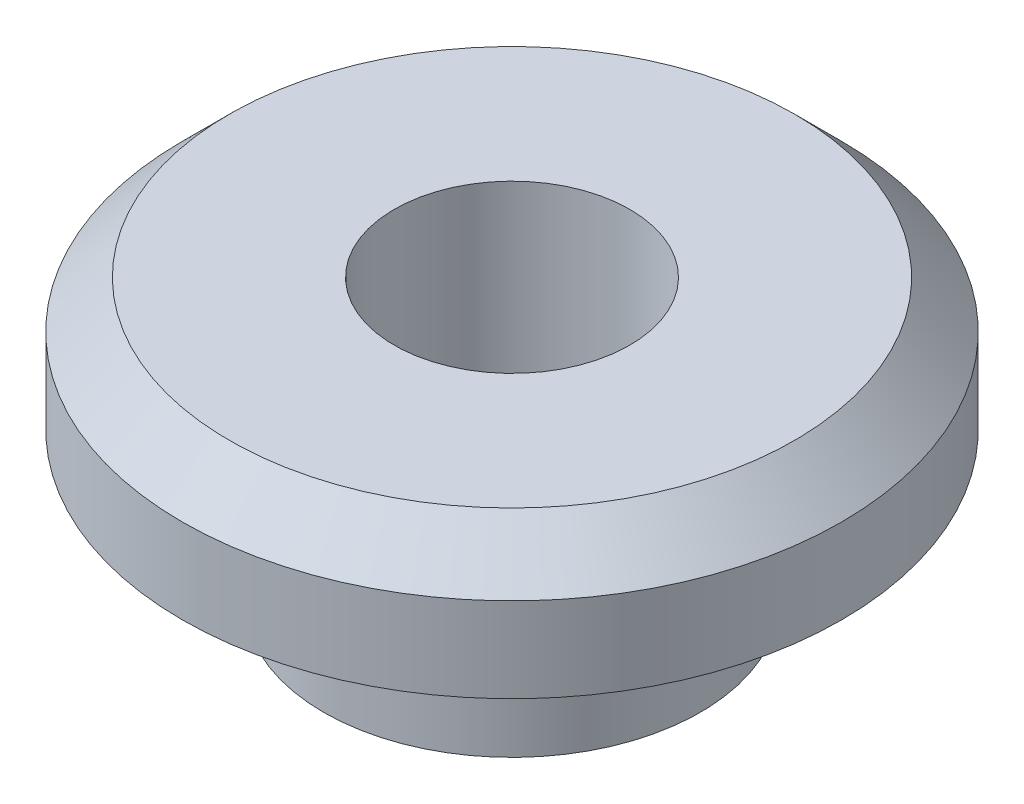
ISO-10303-21;
HEADER;
FILE_DESCRIPTION(('STEP AP214'),'2;1');
FILE_NAME('part.step','',(''),(''),'','','');
FILE_SCHEMA(('AUTOMOTIVE_DESIGN { 1 0 10303 214 1 1 1 1 }'));
ENDSEC;
DATA;
#1=APPLICATION_CONTEXT('core data for automotive mechanical design processes');
#2=APPLICATION_PROTOCOL_DEFINITION('international standard','automotive_design',2000,#1);
#3=PRODUCT_CONTEXT('',#1,'mechanical');
#4=PRODUCT('Part','Part','',(#3));
#5=PRODUCT_RELATED_PRODUCT_CATEGORY('part','',(#4));
#6=PRODUCT_DEFINITION_FORMATION('','',#4);
#7=PRODUCT_DEFINITION_CONTEXT('part definition',#1,'design');
#8=PRODUCT_DEFINITION('design','',#6,#7);
#9=PRODUCT_DEFINITION_SHAPE('','',#8);
#10=(LENGTH_UNIT() NAMED_UNIT(*) SI_UNIT(.MILLI.,.METRE.));
#11=(NAMED_UNIT(*) PLANE_ANGLE_UNIT() SI_UNIT($,.RADIAN.));
#12=(NAMED_UNIT(*) SI_UNIT($,.STERADIAN.) SOLID_ANGLE_UNIT());
#13=UNCERTAINTY_MEASURE_WITH_UNIT(LENGTH_MEASURE(1.E-05),#10,'distance_accuracy_value','');
#14=(GEOMETRIC_REPRESENTATION_CONTEXT(3) GLOBAL_UNCERTAINTY_ASSIGNED_CONTEXT((#13)) GLOBAL_UNIT_ASSIGNED_CONTEXT((#10,
#11,#12)) REPRESENTATION_CONTEXT('',''));
#15=CARTESIAN_POINT('',(0.,0.,0.));
#16=DIRECTION('',(0.,0.,1.));
#17=DIRECTION('',(1.,0.,0.));
#18=AXIS2_PLACEMENT_3D('',#15,#16,#17);
#19=CARTESIAN_POINT('',(0.,5.,0.));
#20=DIRECTION('',(0.,-1.,0.));
#21=DIRECTION('',(0.,0.,-1.));
#22=AXIS2_PLACEMENT_3D('',#19,#20,#21);
#23=CONICAL_SURFACE('',#22,7.,0.785398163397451);
#24=CARTESIAN_POINT('',(0.,6.,0.));
#25=DIRECTION('',(0.,-1.,0.));
#26=DIRECTION('',(0.,0.,-1.));
#27=AXIS2_PLACEMENT_3D('',#24,#25,#26);
#28=CIRCLE('',#27,6.);
#29=CARTESIAN_POINT('',(0.,6.,-6.));
#30=VERTEX_POINT('',#29);
#31=EDGE_CURVE('E54',#30,#30,#28,.T.);
#32=ORIENTED_EDGE('',*,*,#31,.T.);
#33=EDGE_LOOP('',(#32));
#34=FACE_BOUND('',#33,.T.);
#35=CARTESIAN_POINT('',(0.,5.,0.));
#36=DIRECTION('',(0.,-1.,0.));
#37=DIRECTION('',(0.,0.,-1.));
#38=AXIS2_PLACEMENT_3D('',#35,#36,#37);
#39=CIRCLE('',#38,7.);
#40=CARTESIAN_POINT('',(0.,5.,-7.));
#41=VERTEX_POINT('',#40);
#42=EDGE_CURVE('E10',#41,#41,#39,.T.);
#43=ORIENTED_EDGE('',*,*,#42,.F.);
#44=EDGE_LOOP('',(#43));
#45=FACE_BOUND('',#44,.T.);
#46=ADVANCED_FACE('F29',(#34,#45),#23,.T.);
#47=CARTESIAN_POINT('',(0.,0.,0.));
#48=DIRECTION('',(0.,-1.,0.));
#49=DIRECTION('',(0.,0.,-1.));
#50=AXIS2_PLACEMENT_3D('',#47,#48,#49);
#51=CYLINDRICAL_SURFACE('',#50,7.);
#52=ORIENTED_EDGE('',*,*,#42,.T.);
#53=EDGE_LOOP('',(#52));
#54=FACE_BOUND('',#53,.T.);
#55=CARTESIAN_POINT('',(0.,3.2,0.));
#56=DIRECTION('',(0.,-1.,0.));
#57=DIRECTION('',(0.,0.,-1.));
#58=AXIS2_PLACEMENT_3D('',#55,#56,#57);
#59=CIRCLE('',#58,7.);
#60=CARTESIAN_POINT('',(0.,3.2,-7.));
#61=VERTEX_POINT('',#60);
#62=EDGE_CURVE('E35',#61,#61,#59,.T.);
#63=ORIENTED_EDGE('',*,*,#62,.F.);
#64=EDGE_LOOP('',(#63));
#65=FACE_BOUND('',#64,.T.);
#66=ADVANCED_FACE('F72',(#54,#65),#51,.T.);
#67=CARTESIAN_POINT('',(7.,3.2,0.));
#68=DIRECTION('',(0.,-1.,0.));
#69=DIRECTION('',(0.,0.,-1.));
#70=AXIS2_PLACEMENT_3D('',#67,#68,#69);
#71=PLANE('',#70);
#72=ORIENTED_EDGE('',*,*,#62,.T.);
#73=EDGE_LOOP('',(#72));
#74=FACE_BOUND('',#73,.T.);
#75=CARTESIAN_POINT('',(0.,3.2,0.));
#76=DIRECTION('',(0.,-1.,0.));
#77=DIRECTION('',(0.,0.,-1.));
#78=AXIS2_PLACEMENT_3D('',#75,#76,#77);
#79=CIRCLE('',#78,4.);
#80=CARTESIAN_POINT('',(0.,3.2,-4.));
#81=VERTEX_POINT('',#80);
#82=EDGE_CURVE('E39',#81,#81,#79,.T.);
#83=ORIENTED_EDGE('',*,*,#82,.F.);
#84=EDGE_LOOP('',(#83));
#85=FACE_BOUND('',#84,.T.);
#86=ADVANCED_FACE('F76',(#74,#85),#71,.T.);
#87=CARTESIAN_POINT('',(0.,0.,0.));
#88=DIRECTION('',(0.,-1.,0.));
#89=DIRECTION('',(0.,0.,-1.));
#90=AXIS2_PLACEMENT_3D('',#87,#88,#89);
#91=CYLINDRICAL_SURFACE('',#90,4.);
#92=ORIENTED_EDGE('',*,*,#82,.T.);
#93=EDGE_LOOP('',(#92));
#94=FACE_BOUND('',#93,.T.);
#95=CARTESIAN_POINT('',(0.,0.,0.));
#96=DIRECTION('',(0.,-1.,0.));
#97=DIRECTION('',(0.,0.,-1.));
#98=AXIS2_PLACEMENT_3D('',#95,#96,#97);
#99=CIRCLE('',#98,4.);
#100=CARTESIAN_POINT('',(0.,0.,-4.));
#101=VERTEX_POINT('',#100);
#102=EDGE_CURVE('E43',#101,#101,#99,.T.);
#103=ORIENTED_EDGE('',*,*,#102,.F.);
#104=EDGE_LOOP('',(#103));
#105=FACE_BOUND('',#104,.T.);
#106=ADVANCED_FACE('F80',(#94,#105),#91,.T.);
#107=CARTESIAN_POINT('',(4.,0.,0.));
#108=DIRECTION('',(0.,-1.,0.));
#109=DIRECTION('',(0.,0.,-1.));
#110=AXIS2_PLACEMENT_3D('',#107,#108,#109);
#111=PLANE('',#110);
#112=ORIENTED_EDGE('',*,*,#102,.T.);
#113=EDGE_LOOP('',(#112));
#114=FACE_BOUND('',#113,.T.);
#115=CARTESIAN_POINT('',(0.,0.,0.));
#116=DIRECTION('',(0.,-1.,0.));
#117=DIRECTION('',(0.,0.,-1.));
#118=AXIS2_PLACEMENT_3D('',#115,#116,#117);
#119=CIRCLE('',#118,2.5);
#120=CARTESIAN_POINT('',(0.,0.,-2.5));
#121=VERTEX_POINT('',#120);
#122=EDGE_CURVE('E48',#121,#121,#119,.T.);
#123=ORIENTED_EDGE('',*,*,#122,.F.);
#124=EDGE_LOOP('',(#123));
#125=FACE_BOUND('',#124,.T.);
#126=ADVANCED_FACE('F68',(#114,#125),#111,.T.);
#127=CARTESIAN_POINT('',(0.,0.,0.));
#128=DIRECTION('',(0.,-1.,0.));
#129=DIRECTION('',(0.,0.,-1.));
#130=AXIS2_PLACEMENT_3D('',#127,#128,#129);
#131=CYLINDRICAL_SURFACE('',#130,2.5);
#132=ORIENTED_EDGE('',*,*,#122,.T.);
#133=EDGE_LOOP('',(#132));
#134=FACE_BOUND('',#133,.T.);
#135=CARTESIAN_POINT('',(0.,6.,0.));
#136=DIRECTION('',(0.,-1.,0.));
#137=DIRECTION('',(0.,0.,-1.));
#138=AXIS2_PLACEMENT_3D('',#135,#136,#137);
#139=CIRCLE('',#138,2.5);
#140=CARTESIAN_POINT('',(0.,6.,-2.5));
#141=VERTEX_POINT('',#140);
#142=EDGE_CURVE('E51',#141,#141,#139,.T.);
#143=ORIENTED_EDGE('',*,*,#142,.F.);
#144=EDGE_LOOP('',(#143));
#145=FACE_BOUND('',#144,.T.);
#146=ADVANCED_FACE('F62',(#134,#145),#131,.F.);
#147=CARTESIAN_POINT('',(2.5,6.,0.));
#148=DIRECTION('',(0.,1.,0.));
#149=DIRECTION('',(0.,0.,1.));
#150=AXIS2_PLACEMENT_3D('',#147,#148,#149);
#151=PLANE('',#150);
#152=ORIENTED_EDGE('',*,*,#142,.T.);
#153=EDGE_LOOP('',(#152));
#154=FACE_BOUND('',#153,.T.);
#155=ORIENTED_EDGE('',*,*,#31,.F.);
#156=EDGE_LOOP('',(#155));
#157=FACE_BOUND('',#156,.T.);
#158=ADVANCED_FACE('F60',(#154,#157),#151,.T.);
#159=CLOSED_SHELL('',(#46,#66,#86,#106,#126,#146,#158));
#160=MANIFOLD_SOLID_BREP('B2',#159);
#161=ADVANCED_BREP_SHAPE_REPRESENTATION('',(#18,#160),#14);
#162=SHAPE_DEFINITION_REPRESENTATION(#9,#161);
ENDSEC;
END-ISO-10303-21;
